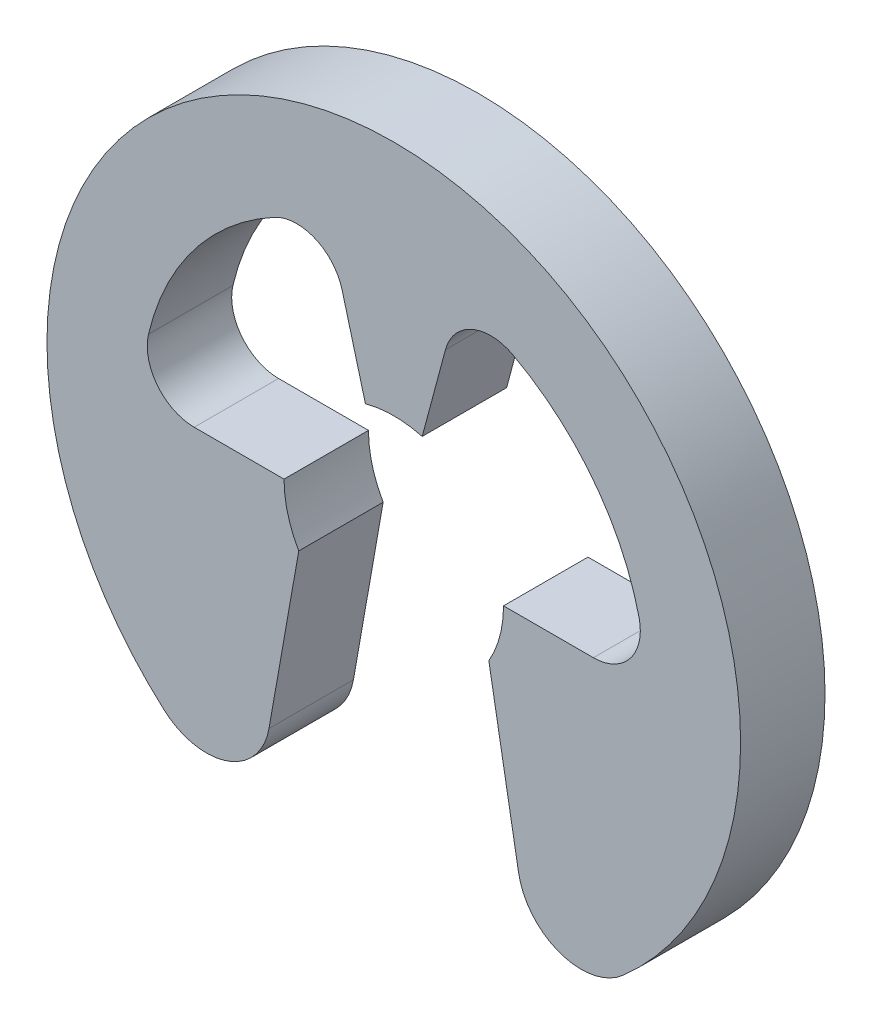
from build123d import *

# Parameters (mm, degrees)
BODY_DEPTH = 0.254


with BuildPart() as part:
    # BodySke → Body (new body)
    with BuildSketch(Plane.XY):
        with BuildLine():
            Line((0.285961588, -0.1651), (0.375423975, -0.672466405))
            ThreePointArc((0.375423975, -0.672466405), (0.500495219, -0.819680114), (0.6900823, -0.782647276))
            ThreePointArc((0.6900823, -0.782647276), (0, 1.043432), (-0.6900823, -0.782647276))
            ThreePointArc((-0.6900823, -0.782647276), (-0.500495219, -0.819680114), (-0.375423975, -0.672466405))
            Line((-0.375423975, -0.672466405), (-0.285961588, -0.1651))
            ThreePointArc((-0.285961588, -0.1651), (-0.318948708, -0.085462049), (-0.3302, 0))
            Line((-0.3302, 0), (-0.600538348, 0))
            ThreePointArc((-0.600538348, 0), (-0.711236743, 0.053533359), (-0.738008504, 0.173546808))
            ThreePointArc((-0.738008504, 0.173546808), (-0.601472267, 0.461525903), (-0.358644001, 0.667944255))
            ThreePointArc((-0.358644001, 0.667944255), (-0.235790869, 0.673146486), (-0.155430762, 0.5800755))
            Line((-0.155430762, 0.5800755), (-0.085462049, 0.318948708))
            ThreePointArc((-0.085462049, 0.318948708), (0, 0.3302), (0.085462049, 0.318948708))
            Line((0.085462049, 0.318948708), (0.155430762, 0.5800755))
            ThreePointArc((0.155430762, 0.5800755), (0.235790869, 0.673146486), (0.358644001, 0.667944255))
            ThreePointArc((0.358644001, 0.667944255), (0.601472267, 0.461525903), (0.738008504, 0.173546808))
            ThreePointArc((0.738008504, 0.173546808), (0.711236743, 0.053533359), (0.600538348, 0))
            Line((0.600538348, 0), (0.3302, 0))
            ThreePointArc((0.3302, 0), (0.318948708, -0.085462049), (0.285961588, -0.1651))
        make_face()
    extrude(amount=-BODY_DEPTH)


solid = part.part
